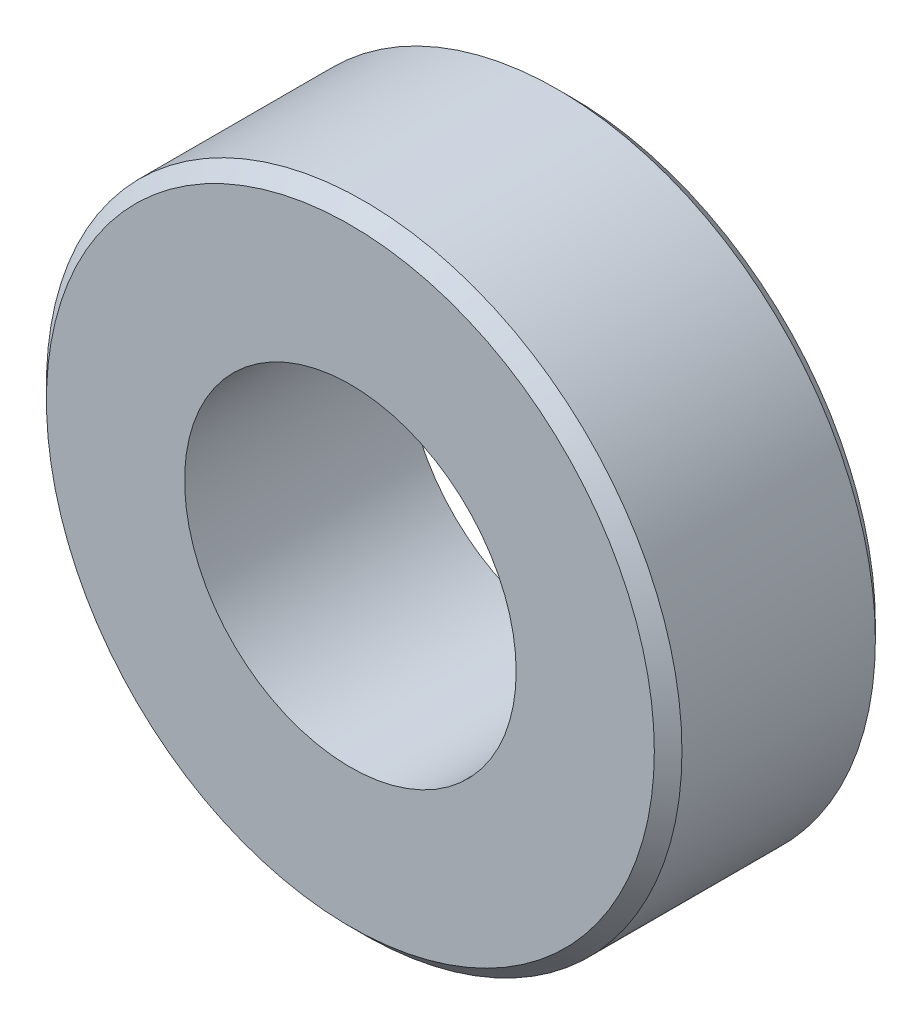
ISO-10303-21;
HEADER;
FILE_DESCRIPTION(('STEP AP214'),'2;1');
FILE_NAME('part.step','',(''),(''),'','','');
FILE_SCHEMA(('AUTOMOTIVE_DESIGN { 1 0 10303 214 1 1 1 1 }'));
ENDSEC;
DATA;
#1=APPLICATION_CONTEXT('core data for automotive mechanical design processes');
#2=APPLICATION_PROTOCOL_DEFINITION('international standard','automotive_design',2000,#1);
#3=PRODUCT_CONTEXT('',#1,'mechanical');
#4=PRODUCT('Part','Part','',(#3));
#5=PRODUCT_RELATED_PRODUCT_CATEGORY('part','',(#4));
#6=PRODUCT_DEFINITION_FORMATION('','',#4);
#7=PRODUCT_DEFINITION_CONTEXT('part definition',#1,'design');
#8=PRODUCT_DEFINITION('design','',#6,#7);
#9=PRODUCT_DEFINITION_SHAPE('','',#8);
#10=(LENGTH_UNIT() NAMED_UNIT(*) SI_UNIT(.MILLI.,.METRE.));
#11=(NAMED_UNIT(*) PLANE_ANGLE_UNIT() SI_UNIT($,.RADIAN.));
#12=(NAMED_UNIT(*) SI_UNIT($,.STERADIAN.) SOLID_ANGLE_UNIT());
#13=UNCERTAINTY_MEASURE_WITH_UNIT(LENGTH_MEASURE(1.E-05),#10,'distance_accuracy_value','');
#14=(GEOMETRIC_REPRESENTATION_CONTEXT(3) GLOBAL_UNCERTAINTY_ASSIGNED_CONTEXT((#13)) GLOBAL_UNIT_ASSIGNED_CONTEXT((#10,
#11,#12)) REPRESENTATION_CONTEXT('',''));
#15=CARTESIAN_POINT('',(0.,0.,0.));
#16=DIRECTION('',(0.,0.,1.));
#17=DIRECTION('',(1.,0.,0.));
#18=AXIS2_PLACEMENT_3D('',#15,#16,#17);
#19=CARTESIAN_POINT('',(0.,0.,8.));
#20=DIRECTION('',(0.,0.,-1.));
#21=DIRECTION('',(-1.,0.,0.));
#22=AXIS2_PLACEMENT_3D('',#19,#20,#21);
#23=CYLINDRICAL_SURFACE('',#22,11.5);
#24=CARTESIAN_POINT('',(0.,0.,0.5));
#25=DIRECTION('',(0.,0.,1.));
#26=DIRECTION('',(1.,0.,0.));
#27=AXIS2_PLACEMENT_3D('',#24,#25,#26);
#28=CIRCLE('',#27,11.5);
#29=CARTESIAN_POINT('',(11.5,0.,0.5));
#30=VERTEX_POINT('',#29);
#31=EDGE_CURVE('E23',#30,#30,#28,.T.);
#32=ORIENTED_EDGE('',*,*,#31,.T.);
#33=EDGE_LOOP('',(#32));
#34=FACE_BOUND('',#33,.T.);
#35=CARTESIAN_POINT('',(0.,0.,7.5));
#36=DIRECTION('',(0.,0.,1.));
#37=DIRECTION('',(1.,0.,0.));
#38=AXIS2_PLACEMENT_3D('',#35,#36,#37);
#39=CIRCLE('',#38,11.5);
#40=CARTESIAN_POINT('',(11.5,0.,7.5));
#41=VERTEX_POINT('',#40);
#42=EDGE_CURVE('E27',#41,#41,#39,.F.);
#43=ORIENTED_EDGE('',*,*,#42,.T.);
#44=EDGE_LOOP('',(#43));
#45=FACE_BOUND('',#44,.T.);
#46=ADVANCED_FACE('F12',(#34,#45),#23,.T.);
#47=CARTESIAN_POINT('',(0.,0.,8.));
#48=DIRECTION('',(0.,0.,1.));
#49=DIRECTION('',(1.,0.,0.));
#50=AXIS2_PLACEMENT_3D('',#47,#48,#49);
#51=PLANE('',#50);
#52=CARTESIAN_POINT('',(0.,0.,8.));
#53=DIRECTION('',(0.,0.,1.));
#54=DIRECTION('',(1.,0.,0.));
#55=AXIS2_PLACEMENT_3D('',#52,#53,#54);
#56=CIRCLE('',#55,11.);
#57=CARTESIAN_POINT('',(11.,0.,8.));
#58=VERTEX_POINT('',#57);
#59=EDGE_CURVE('E8',#58,#58,#56,.T.);
#60=ORIENTED_EDGE('',*,*,#59,.T.);
#61=EDGE_LOOP('',(#60));
#62=FACE_BOUND('',#61,.T.);
#63=CARTESIAN_POINT('',(0.,0.,8.));
#64=DIRECTION('',(0.,0.,1.));
#65=DIRECTION('',(1.,0.,0.));
#66=AXIS2_PLACEMENT_3D('',#63,#64,#65);
#67=CIRCLE('',#66,6.);
#68=CARTESIAN_POINT('',(6.,0.,8.));
#69=VERTEX_POINT('',#68);
#70=EDGE_CURVE('E35',#69,#69,#67,.T.);
#71=ORIENTED_EDGE('',*,*,#70,.F.);
#72=EDGE_LOOP('',(#71));
#73=FACE_BOUND('',#72,.T.);
#74=ADVANCED_FACE('F41',(#62,#73),#51,.T.);
#75=CARTESIAN_POINT('',(0.,0.,0.));
#76=DIRECTION('',(0.,0.,1.));
#77=DIRECTION('',(1.,0.,0.));
#78=AXIS2_PLACEMENT_3D('',#75,#76,#77);
#79=PLANE('',#78);
#80=CARTESIAN_POINT('',(0.,0.,0.));
#81=DIRECTION('',(0.,0.,1.));
#82=DIRECTION('',(1.,0.,0.));
#83=AXIS2_PLACEMENT_3D('',#80,#81,#82);
#84=CIRCLE('',#83,11.);
#85=CARTESIAN_POINT('',(11.,0.,0.));
#86=VERTEX_POINT('',#85);
#87=EDGE_CURVE('E19',#86,#86,#84,.F.);
#88=ORIENTED_EDGE('',*,*,#87,.T.);
#89=EDGE_LOOP('',(#88));
#90=FACE_BOUND('',#89,.T.);
#91=CARTESIAN_POINT('',(0.,0.,0.));
#92=DIRECTION('',(0.,0.,1.));
#93=DIRECTION('',(1.,0.,0.));
#94=AXIS2_PLACEMENT_3D('',#91,#92,#93);
#95=CIRCLE('',#94,6.);
#96=CARTESIAN_POINT('',(6.,0.,0.));
#97=VERTEX_POINT('',#96);
#98=EDGE_CURVE('E32',#97,#97,#95,.T.);
#99=ORIENTED_EDGE('',*,*,#98,.T.);
#100=EDGE_LOOP('',(#99));
#101=FACE_BOUND('',#100,.T.);
#102=ADVANCED_FACE('F43',(#90,#101),#79,.F.);
#103=CARTESIAN_POINT('',(0.,0.,0.));
#104=DIRECTION('',(0.,0.,1.));
#105=DIRECTION('',(1.,0.,0.));
#106=AXIS2_PLACEMENT_3D('',#103,#104,#105);
#107=CYLINDRICAL_SURFACE('',#106,6.);
#108=ORIENTED_EDGE('',*,*,#98,.F.);
#109=EDGE_LOOP('',(#108));
#110=FACE_BOUND('',#109,.T.);
#111=ORIENTED_EDGE('',*,*,#70,.T.);
#112=EDGE_LOOP('',(#111));
#113=FACE_BOUND('',#112,.T.);
#114=ADVANCED_FACE('F39',(#110,#113),#107,.F.);
#115=CARTESIAN_POINT('',(0.,0.,0.5));
#116=DIRECTION('',(0.,0.,1.));
#117=DIRECTION('',(1.,0.,0.));
#118=AXIS2_PLACEMENT_3D('',#115,#116,#117);
#119=CONICAL_SURFACE('',#118,11.5,0.785398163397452);
#120=ORIENTED_EDGE('',*,*,#87,.F.);
#121=EDGE_LOOP('',(#120));
#122=FACE_BOUND('',#121,.T.);
#123=ORIENTED_EDGE('',*,*,#31,.F.);
#124=EDGE_LOOP('',(#123));
#125=FACE_BOUND('',#124,.T.);
#126=ADVANCED_FACE('F55',(#122,#125),#119,.T.);
#127=CARTESIAN_POINT('',(0.,0.,8.));
#128=DIRECTION('',(0.,0.,-1.));
#129=DIRECTION('',(-1.,0.,0.));
#130=AXIS2_PLACEMENT_3D('',#127,#128,#129);
#131=CONICAL_SURFACE('',#130,11.,0.785398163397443);
#132=ORIENTED_EDGE('',*,*,#42,.F.);
#133=EDGE_LOOP('',(#132));
#134=FACE_BOUND('',#133,.T.);
#135=ORIENTED_EDGE('',*,*,#59,.F.);
#136=EDGE_LOOP('',(#135));
#137=FACE_BOUND('',#136,.T.);
#138=ADVANCED_FACE('F14',(#134,#137),#131,.T.);
#139=CLOSED_SHELL('',(#46,#74,#102,#114,#126,#138));
#140=MANIFOLD_SOLID_BREP('B1',#139);
#141=ADVANCED_BREP_SHAPE_REPRESENTATION('',(#18,#140),#14);
#142=SHAPE_DEFINITION_REPRESENTATION(#9,#141);
ENDSEC;
END-ISO-10303-21;
